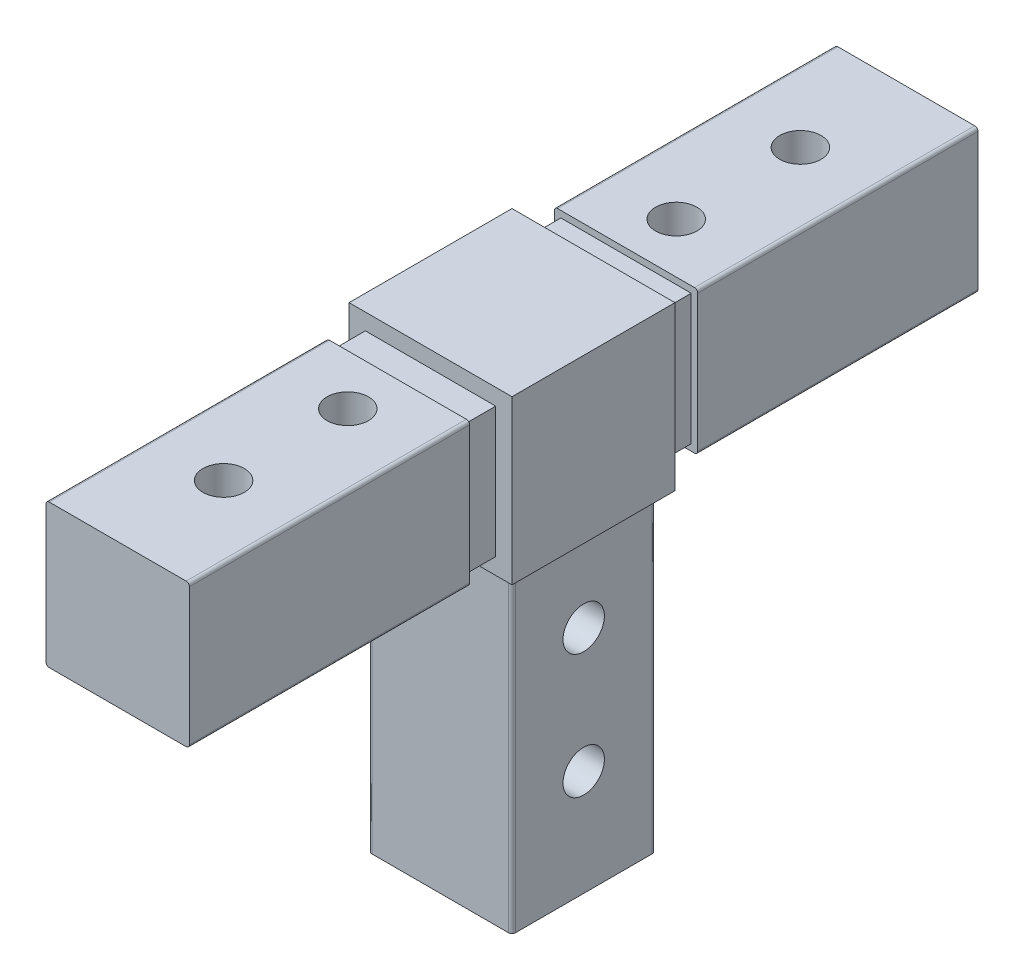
ISO-10303-21;
HEADER;
FILE_DESCRIPTION(('STEP AP214'),'2;1');
FILE_NAME('part.step','',(''),(''),'','','');
FILE_SCHEMA(('AUTOMOTIVE_DESIGN { 1 0 10303 214 1 1 1 1 }'));
ENDSEC;
DATA;
#1=APPLICATION_CONTEXT('core data for automotive mechanical design processes');
#2=APPLICATION_PROTOCOL_DEFINITION('international standard','automotive_design',2000,#1);
#3=PRODUCT_CONTEXT('',#1,'mechanical');
#4=PRODUCT('Part','Part','',(#3));
#5=PRODUCT_RELATED_PRODUCT_CATEGORY('part','',(#4));
#6=PRODUCT_DEFINITION_FORMATION('','',#4);
#7=PRODUCT_DEFINITION_CONTEXT('part definition',#1,'design');
#8=PRODUCT_DEFINITION('design','',#6,#7);
#9=PRODUCT_DEFINITION_SHAPE('','',#8);
#10=(LENGTH_UNIT() NAMED_UNIT(*) SI_UNIT(.MILLI.,.METRE.));
#11=(NAMED_UNIT(*) PLANE_ANGLE_UNIT() SI_UNIT($,.RADIAN.));
#12=(NAMED_UNIT(*) SI_UNIT($,.STERADIAN.) SOLID_ANGLE_UNIT());
#13=UNCERTAINTY_MEASURE_WITH_UNIT(LENGTH_MEASURE(1.E-05),#10,'distance_accuracy_value','');
#14=(GEOMETRIC_REPRESENTATION_CONTEXT(3) GLOBAL_UNCERTAINTY_ASSIGNED_CONTEXT((#13)) GLOBAL_UNIT_ASSIGNED_CONTEXT((#10,
#11,#12)) REPRESENTATION_CONTEXT('',''));
#15=CARTESIAN_POINT('',(0.,0.,0.));
#16=DIRECTION('',(0.,0.,1.));
#17=DIRECTION('',(1.,0.,0.));
#18=AXIS2_PLACEMENT_3D('',#15,#16,#17);
#19=CARTESIAN_POINT('',(0.,-12.5,0.));
#20=DIRECTION('',(0.,1.,0.));
#21=DIRECTION('',(0.,0.,1.));
#22=AXIS2_PLACEMENT_3D('',#19,#20,#21);
#23=PLANE('',#22);
#24=DIRECTION('',(0.,0.,1.));
#25=VECTOR('',#24,1.);
#26=CARTESIAN_POINT('',(12.5,-12.5,12.5));
#27=LINE('',#26,#25);
#28=CARTESIAN_POINT('',(12.5,-12.5,-12.5));
#29=VERTEX_POINT('',#28);
#30=CARTESIAN_POINT('',(12.5,-12.5,12.5));
#31=VERTEX_POINT('',#30);
#32=EDGE_CURVE('E347',#29,#31,#27,.T.);
#33=ORIENTED_EDGE('',*,*,#32,.T.);
#34=DIRECTION('',(-1.,0.,0.));
#35=VECTOR('',#34,1.);
#36=CARTESIAN_POINT('',(-12.5,-12.5,12.5));
#37=LINE('',#36,#35);
#38=CARTESIAN_POINT('',(-12.5,-12.5,12.5));
#39=VERTEX_POINT('',#38);
#40=EDGE_CURVE('E350',#31,#39,#37,.T.);
#41=ORIENTED_EDGE('',*,*,#40,.T.);
#42=DIRECTION('',(0.,0.,-1.));
#43=VECTOR('',#42,1.);
#44=CARTESIAN_POINT('',(-12.5,-12.5,-12.5));
#45=LINE('',#44,#43);
#46=CARTESIAN_POINT('',(-12.5,-12.5,-12.5));
#47=VERTEX_POINT('',#46);
#48=EDGE_CURVE('E353',#39,#47,#45,.T.);
#49=ORIENTED_EDGE('',*,*,#48,.T.);
#50=DIRECTION('',(1.,0.,0.));
#51=VECTOR('',#50,1.);
#52=CARTESIAN_POINT('',(12.5,-12.5,-12.5));
#53=LINE('',#52,#51);
#54=EDGE_CURVE('E356',#47,#29,#53,.T.);
#55=ORIENTED_EDGE('',*,*,#54,.T.);
#56=EDGE_LOOP('',(#33,#41,#49,#55));
#57=FACE_BOUND('',#56,.T.);
#58=DIRECTION('',(0.,0.,-1.));
#59=VECTOR('',#58,1.);
#60=CARTESIAN_POINT('',(-11.,-12.5,-11.));
#61=LINE('',#60,#59);
#62=CARTESIAN_POINT('',(-11.,-12.5,10.4999999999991));
#63=VERTEX_POINT('',#62);
#64=CARTESIAN_POINT('',(-11.,-12.5,-10.4999999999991));
#65=VERTEX_POINT('',#64);
#66=EDGE_CURVE('E927',#63,#65,#61,.T.);
#67=ORIENTED_EDGE('',*,*,#66,.F.);
#68=CARTESIAN_POINT('',(-10.4999999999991,-12.5,10.4999999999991));
#69=DIRECTION('',(0.,1.,0.));
#70=DIRECTION('',(0.,0.,1.));
#71=AXIS2_PLACEMENT_3D('',#68,#69,#70);
#72=CIRCLE('',#71,0.500000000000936);
#73=CARTESIAN_POINT('',(-10.4999999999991,-12.5,11.));
#74=VERTEX_POINT('',#73);
#75=EDGE_CURVE('E56',#63,#74,#72,.T.);
#76=ORIENTED_EDGE('',*,*,#75,.T.);
#77=DIRECTION('',(-1.,0.,0.));
#78=VECTOR('',#77,1.);
#79=CARTESIAN_POINT('',(-11.,-12.5,11.));
#80=LINE('',#79,#78);
#81=CARTESIAN_POINT('',(10.4999999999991,-12.5,11.));
#82=VERTEX_POINT('',#81);
#83=EDGE_CURVE('E925',#82,#74,#80,.T.);
#84=ORIENTED_EDGE('',*,*,#83,.F.);
#85=CARTESIAN_POINT('',(10.4999999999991,-12.5,10.4999999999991));
#86=DIRECTION('',(0.,1.,0.));
#87=DIRECTION('',(0.,0.,1.));
#88=AXIS2_PLACEMENT_3D('',#85,#86,#87);
#89=CIRCLE('',#88,0.500000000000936);
#90=CARTESIAN_POINT('',(11.,-12.5,10.4999999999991));
#91=VERTEX_POINT('',#90);
#92=EDGE_CURVE('E920',#82,#91,#89,.T.);
#93=ORIENTED_EDGE('',*,*,#92,.T.);
#94=DIRECTION('',(0.,0.,1.));
#95=VECTOR('',#94,1.);
#96=CARTESIAN_POINT('',(11.,-12.5,11.));
#97=LINE('',#96,#95);
#98=CARTESIAN_POINT('',(11.,-12.5,-10.4999999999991));
#99=VERTEX_POINT('',#98);
#100=EDGE_CURVE('E937',#99,#91,#97,.T.);
#101=ORIENTED_EDGE('',*,*,#100,.F.);
#102=CARTESIAN_POINT('',(10.4999999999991,-12.5,-10.4999999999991));
#103=DIRECTION('',(0.,1.,0.));
#104=DIRECTION('',(0.,0.,1.));
#105=AXIS2_PLACEMENT_3D('',#102,#103,#104);
#106=CIRCLE('',#105,0.500000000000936);
#107=CARTESIAN_POINT('',(10.4999999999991,-12.5,-11.));
#108=VERTEX_POINT('',#107);
#109=EDGE_CURVE('E12',#99,#108,#106,.T.);
#110=ORIENTED_EDGE('',*,*,#109,.T.);
#111=DIRECTION('',(1.,0.,0.));
#112=VECTOR('',#111,1.);
#113=CARTESIAN_POINT('',(11.,-12.5,-11.));
#114=LINE('',#113,#112);
#115=CARTESIAN_POINT('',(-10.4999999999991,-12.5,-11.));
#116=VERTEX_POINT('',#115);
#117=EDGE_CURVE('E962',#116,#108,#114,.T.);
#118=ORIENTED_EDGE('',*,*,#117,.F.);
#119=CARTESIAN_POINT('',(-10.4999999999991,-12.5,-10.4999999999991));
#120=DIRECTION('',(0.,1.,0.));
#121=DIRECTION('',(0.,0.,1.));
#122=AXIS2_PLACEMENT_3D('',#119,#120,#121);
#123=CIRCLE('',#122,0.500000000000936);
#124=EDGE_CURVE('E918',#116,#65,#123,.T.);
#125=ORIENTED_EDGE('',*,*,#124,.T.);
#126=EDGE_LOOP('',(#67,#76,#84,#93,#101,#110,#118,#125));
#127=FACE_BOUND('',#126,.T.);
#128=ADVANCED_FACE('F48',(#57,#127),#23,.F.);
#129=CARTESIAN_POINT('',(-10.,11.,-60.5));
#130=DIRECTION('',(1.,0.,0.));
#131=DIRECTION('',(0.,0.,-1.));
#132=AXIS2_PLACEMENT_3D('',#129,#130,#131);
#133=PLANE('',#132);
#134=DIRECTION('',(0.,1.,0.));
#135=VECTOR('',#134,1.);
#136=CARTESIAN_POINT('',(-10.,11.,-17.5));
#137=LINE('',#136,#135);
#138=CARTESIAN_POINT('',(-10.,-10.,-17.5));
#139=VERTEX_POINT('',#138);
#140=CARTESIAN_POINT('',(-10.,10.,-17.5));
#141=VERTEX_POINT('',#140);
#142=EDGE_CURVE('E282',#139,#141,#137,.T.);
#143=ORIENTED_EDGE('',*,*,#142,.F.);
#144=DIRECTION('',(0.,0.,1.));
#145=VECTOR('',#144,1.);
#146=CARTESIAN_POINT('',(-10.,-10.,-17.5));
#147=LINE('',#146,#145);
#148=CARTESIAN_POINT('',(-10.,-10.,-12.5));
#149=VERTEX_POINT('',#148);
#150=EDGE_CURVE('E286',#139,#149,#147,.T.);
#151=ORIENTED_EDGE('',*,*,#150,.T.);
#152=DIRECTION('',(0.,1.,0.));
#153=VECTOR('',#152,1.);
#154=CARTESIAN_POINT('',(-10.,11.,-12.5));
#155=LINE('',#154,#153);
#156=CARTESIAN_POINT('',(-10.,10.,-12.5));
#157=VERTEX_POINT('',#156);
#158=EDGE_CURVE('E332',#149,#157,#155,.T.);
#159=ORIENTED_EDGE('',*,*,#158,.T.);
#160=DIRECTION('',(0.,0.,1.));
#161=VECTOR('',#160,1.);
#162=CARTESIAN_POINT('',(-10.,10.,-17.5));
#163=LINE('',#162,#161);
#164=EDGE_CURVE('E288',#141,#157,#163,.T.);
#165=ORIENTED_EDGE('',*,*,#164,.F.);
#166=EDGE_LOOP('',(#143,#151,#159,#165));
#167=FACE_BOUND('',#166,.T.);
#168=ADVANCED_FACE('F284',(#167),#133,.F.);
#169=CARTESIAN_POINT('',(11.,11.,-60.5));
#170=DIRECTION('',(0.,-1.,0.));
#171=DIRECTION('',(0.,0.,-1.));
#172=AXIS2_PLACEMENT_3D('',#169,#170,#171);
#173=PLANE('',#172);
#174=CARTESIAN_POINT('',(0.,11.,-44.25));
#175=DIRECTION('',(0.,1.,0.));
#176=DIRECTION('',(-1.,0.,0.));
#177=AXIS2_PLACEMENT_3D('',#174,#175,#176);
#178=CIRCLE('',#177,3.175);
#179=CARTESIAN_POINT('',(-3.175,11.,-44.25));
#180=VERTEX_POINT('',#179);
#181=EDGE_CURVE('E1197',#180,#180,#178,.T.);
#182=ORIENTED_EDGE('',*,*,#181,.F.);
#183=EDGE_LOOP('',(#182));
#184=FACE_BOUND('',#183,.T.);
#185=CARTESIAN_POINT('',(0.,11.,-25.2));
#186=DIRECTION('',(0.,1.,0.));
#187=DIRECTION('',(-1.,0.,0.));
#188=AXIS2_PLACEMENT_3D('',#185,#186,#187);
#189=CIRCLE('',#188,3.175);
#190=CARTESIAN_POINT('',(-3.175,11.,-25.2));
#191=VERTEX_POINT('',#190);
#192=EDGE_CURVE('E1190',#191,#191,#189,.T.);
#193=ORIENTED_EDGE('',*,*,#192,.F.);
#194=EDGE_LOOP('',(#193));
#195=FACE_BOUND('',#194,.T.);
#196=DIRECTION('',(1.,0.,0.));
#197=VECTOR('',#196,1.);
#198=CARTESIAN_POINT('',(11.,11.,-60.5));
#199=LINE('',#198,#197);
#200=CARTESIAN_POINT('',(-10.4999999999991,11.,-60.5));
#201=VERTEX_POINT('',#200);
#202=CARTESIAN_POINT('',(10.4999999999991,11.,-60.5));
#203=VERTEX_POINT('',#202);
#204=EDGE_CURVE('E336',#201,#203,#199,.T.);
#205=ORIENTED_EDGE('',*,*,#204,.F.);
#206=DIRECTION('',(0.,0.,-1.));
#207=VECTOR('',#206,1.);
#208=CARTESIAN_POINT('',(-10.4999999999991,11.,-60.5));
#209=LINE('',#208,#207);
#210=CARTESIAN_POINT('',(-10.4999999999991,11.,-17.5));
#211=VERTEX_POINT('',#210);
#212=EDGE_CURVE('E916',#201,#211,#209,.F.);
#213=ORIENTED_EDGE('',*,*,#212,.T.);
#214=DIRECTION('',(-1.,0.,0.));
#215=VECTOR('',#214,1.);
#216=CARTESIAN_POINT('',(11.,11.,-17.5));
#217=LINE('',#216,#215);
#218=CARTESIAN_POINT('',(10.4999999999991,11.,-17.5));
#219=VERTEX_POINT('',#218);
#220=EDGE_CURVE('E320',#219,#211,#217,.T.);
#221=ORIENTED_EDGE('',*,*,#220,.F.);
#222=DIRECTION('',(0.,0.,1.));
#223=VECTOR('',#222,1.);
#224=CARTESIAN_POINT('',(10.4999999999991,11.,-60.5));
#225=LINE('',#224,#223);
#226=EDGE_CURVE('E914',#219,#203,#225,.F.);
#227=ORIENTED_EDGE('',*,*,#226,.T.);
#228=EDGE_LOOP('',(#205,#213,#221,#227));
#229=FACE_BOUND('',#228,.T.);
#230=ADVANCED_FACE('F980',(#184,#195,#229),#173,.F.);
#231=CARTESIAN_POINT('',(11.,-11.,-60.5));
#232=DIRECTION('',(-1.,0.,0.));
#233=DIRECTION('',(0.,-1.,0.));
#234=AXIS2_PLACEMENT_3D('',#231,#232,#233);
#235=PLANE('',#234);
#236=DIRECTION('',(0.,1.,0.));
#237=VECTOR('',#236,1.);
#238=CARTESIAN_POINT('',(11.,-11.,-17.5));
#239=LINE('',#238,#237);
#240=CARTESIAN_POINT('',(11.,-10.4999999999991,-17.5));
#241=VERTEX_POINT('',#240);
#242=CARTESIAN_POINT('',(11.,10.4999999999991,-17.5));
#243=VERTEX_POINT('',#242);
#244=EDGE_CURVE('E311',#241,#243,#239,.T.);
#245=ORIENTED_EDGE('',*,*,#244,.F.);
#246=DIRECTION('',(0.,0.,1.));
#247=VECTOR('',#246,1.);
#248=CARTESIAN_POINT('',(11.,-10.4999999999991,-60.5));
#249=LINE('',#248,#247);
#250=CARTESIAN_POINT('',(11.,-10.4999999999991,-60.5));
#251=VERTEX_POINT('',#250);
#252=EDGE_CURVE('E903',#241,#251,#249,.F.);
#253=ORIENTED_EDGE('',*,*,#252,.T.);
#254=DIRECTION('',(0.,-1.,0.));
#255=VECTOR('',#254,1.);
#256=CARTESIAN_POINT('',(11.,-11.,-60.5));
#257=LINE('',#256,#255);
#258=CARTESIAN_POINT('',(11.,10.4999999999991,-60.5));
#259=VERTEX_POINT('',#258);
#260=EDGE_CURVE('E339',#259,#251,#257,.T.);
#261=ORIENTED_EDGE('',*,*,#260,.F.);
#262=DIRECTION('',(0.,0.,1.));
#263=VECTOR('',#262,1.);
#264=CARTESIAN_POINT('',(11.,10.4999999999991,-60.5));
#265=LINE('',#264,#263);
#266=EDGE_CURVE('E900',#259,#243,#265,.T.);
#267=ORIENTED_EDGE('',*,*,#266,.T.);
#268=EDGE_LOOP('',(#245,#253,#261,#267));
#269=FACE_BOUND('',#268,.T.);
#270=ADVANCED_FACE('F989',(#269),#235,.F.);
#271=CARTESIAN_POINT('',(-10.,-11.,-60.5));
#272=DIRECTION('',(0.,1.,0.));
#273=DIRECTION('',(0.,0.,1.));
#274=AXIS2_PLACEMENT_3D('',#271,#272,#273);
#275=PLANE('',#274);
#276=CARTESIAN_POINT('',(0.,-11.,-44.25));
#277=DIRECTION('',(0.,-1.,0.));
#278=DIRECTION('',(0.,0.,-1.));
#279=AXIS2_PLACEMENT_3D('',#276,#277,#278);
#280=CIRCLE('',#279,3.175);
#281=CARTESIAN_POINT('',(0.,-11.,-47.425));
#282=VERTEX_POINT('',#281);
#283=EDGE_CURVE('E1200',#282,#282,#280,.F.);
#284=ORIENTED_EDGE('',*,*,#283,.T.);
#285=EDGE_LOOP('',(#284));
#286=FACE_BOUND('',#285,.T.);
#287=CARTESIAN_POINT('',(0.,-11.,-25.2));
#288=DIRECTION('',(0.,-1.,0.));
#289=DIRECTION('',(0.,0.,-1.));
#290=AXIS2_PLACEMENT_3D('',#287,#288,#289);
#291=CIRCLE('',#290,3.175);
#292=CARTESIAN_POINT('',(0.,-11.,-28.375));
#293=VERTEX_POINT('',#292);
#294=EDGE_CURVE('E1194',#293,#293,#291,.F.);
#295=ORIENTED_EDGE('',*,*,#294,.T.);
#296=EDGE_LOOP('',(#295));
#297=FACE_BOUND('',#296,.T.);
#298=DIRECTION('',(1.,0.,0.));
#299=VECTOR('',#298,1.);
#300=CARTESIAN_POINT('',(-10.,-11.,-17.5));
#301=LINE('',#300,#299);
#302=CARTESIAN_POINT('',(-10.4999999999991,-11.,-17.5));
#303=VERTEX_POINT('',#302);
#304=CARTESIAN_POINT('',(10.4999999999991,-11.,-17.5));
#305=VERTEX_POINT('',#304);
#306=EDGE_CURVE('E307',#303,#305,#301,.T.);
#307=ORIENTED_EDGE('',*,*,#306,.F.);
#308=DIRECTION('',(0.,0.,1.));
#309=VECTOR('',#308,1.);
#310=CARTESIAN_POINT('',(-10.4999999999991,-11.,-60.5));
#311=LINE('',#310,#309);
#312=CARTESIAN_POINT('',(-10.4999999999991,-11.,-60.5));
#313=VERTEX_POINT('',#312);
#314=EDGE_CURVE('E837',#303,#313,#311,.F.);
#315=ORIENTED_EDGE('',*,*,#314,.T.);
#316=DIRECTION('',(-1.,0.,0.));
#317=VECTOR('',#316,1.);
#318=CARTESIAN_POINT('',(-10.,-11.,-60.5));
#319=LINE('',#318,#317);
#320=CARTESIAN_POINT('',(10.4999999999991,-11.,-60.5));
#321=VERTEX_POINT('',#320);
#322=EDGE_CURVE('E342',#321,#313,#319,.T.);
#323=ORIENTED_EDGE('',*,*,#322,.F.);
#324=DIRECTION('',(0.,0.,1.));
#325=VECTOR('',#324,1.);
#326=CARTESIAN_POINT('',(10.4999999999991,-11.,-60.5));
#327=LINE('',#326,#325);
#328=EDGE_CURVE('E834',#321,#305,#327,.T.);
#329=ORIENTED_EDGE('',*,*,#328,.T.);
#330=EDGE_LOOP('',(#307,#315,#323,#329));
#331=FACE_BOUND('',#330,.T.);
#332=ADVANCED_FACE('F998',(#286,#297,#331),#275,.F.);
#333=CARTESIAN_POINT('',(0.,0.,-12.5));
#334=DIRECTION('',(0.,0.,1.));
#335=DIRECTION('',(1.,0.,0.));
#336=AXIS2_PLACEMENT_3D('',#333,#334,#335);
#337=PLANE('',#336);
#338=DIRECTION('',(1.,0.,0.));
#339=VECTOR('',#338,1.);
#340=CARTESIAN_POINT('',(-10.,10.,-12.5));
#341=LINE('',#340,#339);
#342=CARTESIAN_POINT('',(10.,10.,-12.5));
#343=VERTEX_POINT('',#342);
#344=EDGE_CURVE('E314',#157,#343,#341,.T.);
#345=ORIENTED_EDGE('',*,*,#344,.F.);
#346=ORIENTED_EDGE('',*,*,#158,.F.);
#347=DIRECTION('',(-1.,0.,0.));
#348=VECTOR('',#347,1.);
#349=CARTESIAN_POINT('',(10.,-10.,-12.5));
#350=LINE('',#349,#348);
#351=CARTESIAN_POINT('',(10.,-10.,-12.5));
#352=VERTEX_POINT('',#351);
#353=EDGE_CURVE('E302',#352,#149,#350,.T.);
#354=ORIENTED_EDGE('',*,*,#353,.F.);
#355=DIRECTION('',(0.,-1.,0.));
#356=VECTOR('',#355,1.);
#357=CARTESIAN_POINT('',(10.,10.,-12.5));
#358=LINE('',#357,#356);
#359=EDGE_CURVE('E308',#343,#352,#358,.T.);
#360=ORIENTED_EDGE('',*,*,#359,.F.);
#361=EDGE_LOOP('',(#345,#346,#354,#360));
#362=FACE_BOUND('',#361,.T.);
#363=DIRECTION('',(0.,-1.,0.));
#364=VECTOR('',#363,1.);
#365=CARTESIAN_POINT('',(-12.5,12.5,-12.5));
#366=LINE('',#365,#364);
#367=CARTESIAN_POINT('',(-12.5,12.5,-12.5));
#368=VERTEX_POINT('',#367);
#369=EDGE_CURVE('E805',#368,#47,#366,.T.);
#370=ORIENTED_EDGE('',*,*,#369,.F.);
#371=DIRECTION('',(-1.,0.,0.));
#372=VECTOR('',#371,1.);
#373=CARTESIAN_POINT('',(-12.5,12.5,-12.5));
#374=LINE('',#373,#372);
#375=CARTESIAN_POINT('',(12.5,12.5,-12.5));
#376=VERTEX_POINT('',#375);
#377=EDGE_CURVE('E370',#376,#368,#374,.T.);
#378=ORIENTED_EDGE('',*,*,#377,.F.);
#379=DIRECTION('',(0.,1.,0.));
#380=VECTOR('',#379,1.);
#381=CARTESIAN_POINT('',(12.5,-12.5,-12.5));
#382=LINE('',#381,#380);
#383=EDGE_CURVE('E548',#29,#376,#382,.T.);
#384=ORIENTED_EDGE('',*,*,#383,.F.);
#385=ORIENTED_EDGE('',*,*,#54,.F.);
#386=EDGE_LOOP('',(#370,#378,#384,#385));
#387=FACE_BOUND('',#386,.T.);
#388=ADVANCED_FACE('F1066',(#362,#387),#337,.F.);
#389=CARTESIAN_POINT('',(-10.,-10.,17.5));
#390=DIRECTION('',(0.,1.,0.));
#391=DIRECTION('',(0.,0.,1.));
#392=AXIS2_PLACEMENT_3D('',#389,#390,#391);
#393=PLANE('',#392);
#394=DIRECTION('',(-1.,0.,0.));
#395=VECTOR('',#394,1.);
#396=CARTESIAN_POINT('',(-12.5,-10.,12.5));
#397=LINE('',#396,#395);
#398=CARTESIAN_POINT('',(10.,-10.,12.5));
#399=VERTEX_POINT('',#398);
#400=CARTESIAN_POINT('',(-10.,-10.,12.5));
#401=VERTEX_POINT('',#400);
#402=EDGE_CURVE('E345',#399,#401,#397,.T.);
#403=ORIENTED_EDGE('',*,*,#402,.F.);
#404=DIRECTION('',(0.,0.,-1.));
#405=VECTOR('',#404,1.);
#406=CARTESIAN_POINT('',(10.,-10.,17.5));
#407=LINE('',#406,#405);
#408=CARTESIAN_POINT('',(10.,-10.,17.5));
#409=VERTEX_POINT('',#408);
#410=EDGE_CURVE('E421',#409,#399,#407,.T.);
#411=ORIENTED_EDGE('',*,*,#410,.F.);
#412=DIRECTION('',(1.,0.,0.));
#413=VECTOR('',#412,1.);
#414=CARTESIAN_POINT('',(10.,-10.,17.5));
#415=LINE('',#414,#413);
#416=CARTESIAN_POINT('',(-10.,-10.,17.5));
#417=VERTEX_POINT('',#416);
#418=EDGE_CURVE('E402',#417,#409,#415,.T.);
#419=ORIENTED_EDGE('',*,*,#418,.F.);
#420=DIRECTION('',(0.,0.,-1.));
#421=VECTOR('',#420,1.);
#422=CARTESIAN_POINT('',(-10.,-10.,17.5));
#423=LINE('',#422,#421);
#424=EDGE_CURVE('E424',#417,#401,#423,.T.);
#425=ORIENTED_EDGE('',*,*,#424,.T.);
#426=EDGE_LOOP('',(#403,#411,#419,#425));
#427=FACE_BOUND('',#426,.T.);
#428=ADVANCED_FACE('F1062',(#427),#393,.F.);
#429=CARTESIAN_POINT('',(10.,10.,17.5));
#430=DIRECTION('',(0.,-1.,0.));
#431=DIRECTION('',(0.,0.,-1.));
#432=AXIS2_PLACEMENT_3D('',#429,#430,#431);
#433=PLANE('',#432);
#434=DIRECTION('',(1.,0.,0.));
#435=VECTOR('',#434,1.);
#436=CARTESIAN_POINT('',(12.5,10.,12.5));
#437=LINE('',#436,#435);
#438=CARTESIAN_POINT('',(-10.,10.,12.5));
#439=VERTEX_POINT('',#438);
#440=CARTESIAN_POINT('',(10.,10.,12.5));
#441=VERTEX_POINT('',#440);
#442=EDGE_CURVE('E359',#439,#441,#437,.T.);
#443=ORIENTED_EDGE('',*,*,#442,.F.);
#444=DIRECTION('',(0.,0.,-1.));
#445=VECTOR('',#444,1.);
#446=CARTESIAN_POINT('',(-10.,10.,17.5));
#447=LINE('',#446,#445);
#448=CARTESIAN_POINT('',(-10.,10.,17.5));
#449=VERTEX_POINT('',#448);
#450=EDGE_CURVE('E412',#449,#439,#447,.T.);
#451=ORIENTED_EDGE('',*,*,#450,.F.);
#452=DIRECTION('',(-1.,0.,0.));
#453=VECTOR('',#452,1.);
#454=CARTESIAN_POINT('',(-10.,10.,17.5));
#455=LINE('',#454,#453);
#456=CARTESIAN_POINT('',(10.,10.,17.5));
#457=VERTEX_POINT('',#456);
#458=EDGE_CURVE('E409',#457,#449,#455,.T.);
#459=ORIENTED_EDGE('',*,*,#458,.F.);
#460=DIRECTION('',(0.,0.,-1.));
#461=VECTOR('',#460,1.);
#462=CARTESIAN_POINT('',(10.,10.,17.5));
#463=LINE('',#462,#461);
#464=EDGE_CURVE('E418',#457,#441,#463,.T.);
#465=ORIENTED_EDGE('',*,*,#464,.T.);
#466=EDGE_LOOP('',(#443,#451,#459,#465));
#467=FACE_BOUND('',#466,.T.);
#468=ADVANCED_FACE('F1058',(#467),#433,.F.);
#469=CARTESIAN_POINT('',(0.,0.,12.5));
#470=DIRECTION('',(0.,0.,1.));
#471=DIRECTION('',(1.,0.,0.));
#472=AXIS2_PLACEMENT_3D('',#469,#470,#471);
#473=PLANE('',#472);
#474=ORIENTED_EDGE('',*,*,#40,.F.);
#475=DIRECTION('',(0.,1.,0.));
#476=VECTOR('',#475,1.);
#477=CARTESIAN_POINT('',(12.5,-12.5,12.5));
#478=LINE('',#477,#476);
#479=CARTESIAN_POINT('',(12.5,12.5,12.5));
#480=VERTEX_POINT('',#479);
#481=EDGE_CURVE('E806',#31,#480,#478,.T.);
#482=ORIENTED_EDGE('',*,*,#481,.T.);
#483=DIRECTION('',(1.,0.,0.));
#484=VECTOR('',#483,1.);
#485=CARTESIAN_POINT('',(12.5,12.5,12.5));
#486=LINE('',#485,#484);
#487=CARTESIAN_POINT('',(-12.5,12.5,12.5));
#488=VERTEX_POINT('',#487);
#489=EDGE_CURVE('E364',#488,#480,#486,.T.);
#490=ORIENTED_EDGE('',*,*,#489,.F.);
#491=DIRECTION('',(0.,-1.,0.));
#492=VECTOR('',#491,1.);
#493=CARTESIAN_POINT('',(-12.5,12.5,12.5));
#494=LINE('',#493,#492);
#495=EDGE_CURVE('E427',#488,#39,#494,.T.);
#496=ORIENTED_EDGE('',*,*,#495,.T.);
#497=EDGE_LOOP('',(#474,#482,#490,#496));
#498=FACE_BOUND('',#497,.T.);
#499=DIRECTION('',(0.,1.,0.));
#500=VECTOR('',#499,1.);
#501=CARTESIAN_POINT('',(10.,10.,12.5));
#502=LINE('',#501,#500);
#503=EDGE_CURVE('E403',#399,#441,#502,.T.);
#504=ORIENTED_EDGE('',*,*,#503,.F.);
#505=ORIENTED_EDGE('',*,*,#402,.T.);
#506=DIRECTION('',(0.,-1.,0.));
#507=VECTOR('',#506,1.);
#508=CARTESIAN_POINT('',(-10.,-10.,12.5));
#509=LINE('',#508,#507);
#510=EDGE_CURVE('E388',#439,#401,#509,.T.);
#511=ORIENTED_EDGE('',*,*,#510,.F.);
#512=ORIENTED_EDGE('',*,*,#442,.T.);
#513=EDGE_LOOP('',(#504,#505,#511,#512));
#514=FACE_BOUND('',#513,.T.);
#515=ADVANCED_FACE('F1061',(#498,#514),#473,.T.);
#516=CARTESIAN_POINT('',(-12.5,12.5,12.5));
#517=DIRECTION('',(1.,0.,0.));
#518=DIRECTION('',(0.,0.,-1.));
#519=AXIS2_PLACEMENT_3D('',#516,#517,#518);
#520=PLANE('',#519);
#521=ORIENTED_EDGE('',*,*,#495,.F.);
#522=DIRECTION('',(0.,0.,1.));
#523=VECTOR('',#522,1.);
#524=CARTESIAN_POINT('',(-12.5,12.5,12.5));
#525=LINE('',#524,#523);
#526=EDGE_CURVE('E361',#368,#488,#525,.T.);
#527=ORIENTED_EDGE('',*,*,#526,.F.);
#528=ORIENTED_EDGE('',*,*,#369,.T.);
#529=ORIENTED_EDGE('',*,*,#48,.F.);
#530=EDGE_LOOP('',(#521,#527,#528,#529));
#531=FACE_BOUND('',#530,.T.);
#532=ADVANCED_FACE('F1070',(#531),#520,.F.);
#533=CARTESIAN_POINT('',(12.5,-12.5,12.5));
#534=DIRECTION('',(-1.,0.,0.));
#535=DIRECTION('',(0.,0.,1.));
#536=AXIS2_PLACEMENT_3D('',#533,#534,#535);
#537=PLANE('',#536);
#538=ORIENTED_EDGE('',*,*,#383,.T.);
#539=DIRECTION('',(0.,0.,-1.));
#540=VECTOR('',#539,1.);
#541=CARTESIAN_POINT('',(12.5,12.5,-12.5));
#542=LINE('',#541,#540);
#543=EDGE_CURVE('E367',#480,#376,#542,.T.);
#544=ORIENTED_EDGE('',*,*,#543,.F.);
#545=ORIENTED_EDGE('',*,*,#481,.F.);
#546=ORIENTED_EDGE('',*,*,#32,.F.);
#547=EDGE_LOOP('',(#538,#544,#545,#546));
#548=FACE_BOUND('',#547,.T.);
#549=ADVANCED_FACE('F1056',(#548),#537,.F.);
#550=CARTESIAN_POINT('',(-10.,-10.,17.5));
#551=DIRECTION('',(1.,0.,0.));
#552=DIRECTION('',(0.,0.,-1.));
#553=AXIS2_PLACEMENT_3D('',#550,#551,#552);
#554=PLANE('',#553);
#555=ORIENTED_EDGE('',*,*,#510,.T.);
#556=ORIENTED_EDGE('',*,*,#424,.F.);
#557=DIRECTION('',(0.,-1.,0.));
#558=VECTOR('',#557,1.);
#559=CARTESIAN_POINT('',(-10.,-10.,17.5));
#560=LINE('',#559,#558);
#561=EDGE_CURVE('E399',#449,#417,#560,.T.);
#562=ORIENTED_EDGE('',*,*,#561,.F.);
#563=ORIENTED_EDGE('',*,*,#450,.T.);
#564=EDGE_LOOP('',(#555,#556,#562,#563));
#565=FACE_BOUND('',#564,.T.);
#566=ADVANCED_FACE('F1052',(#565),#554,.F.);
#567=CARTESIAN_POINT('',(10.,10.,17.5));
#568=DIRECTION('',(-1.,0.,0.));
#569=DIRECTION('',(0.,0.,1.));
#570=AXIS2_PLACEMENT_3D('',#567,#568,#569);
#571=PLANE('',#570);
#572=ORIENTED_EDGE('',*,*,#503,.T.);
#573=ORIENTED_EDGE('',*,*,#464,.F.);
#574=DIRECTION('',(0.,1.,0.));
#575=VECTOR('',#574,1.);
#576=CARTESIAN_POINT('',(10.,10.,17.5));
#577=LINE('',#576,#575);
#578=EDGE_CURVE('E406',#409,#457,#577,.T.);
#579=ORIENTED_EDGE('',*,*,#578,.F.);
#580=ORIENTED_EDGE('',*,*,#410,.T.);
#581=EDGE_LOOP('',(#572,#573,#579,#580));
#582=FACE_BOUND('',#581,.T.);
#583=ADVANCED_FACE('F1048',(#582),#571,.F.);
#584=CARTESIAN_POINT('',(11.,-11.,60.5));
#585=DIRECTION('',(0.,-1.,0.));
#586=DIRECTION('',(0.,0.,-1.));
#587=AXIS2_PLACEMENT_3D('',#584,#585,#586);
#588=PLANE('',#587);
#589=CARTESIAN_POINT('',(0.,-11.,44.25));
#590=DIRECTION('',(0.,-1.,0.));
#591=DIRECTION('',(0.,0.,-1.));
#592=AXIS2_PLACEMENT_3D('',#589,#590,#591);
#593=CIRCLE('',#592,3.175);
#594=CARTESIAN_POINT('',(0.,-11.,41.075));
#595=VERTEX_POINT('',#594);
#596=EDGE_CURVE('E1186',#595,#595,#593,.F.);
#597=ORIENTED_EDGE('',*,*,#596,.T.);
#598=EDGE_LOOP('',(#597));
#599=FACE_BOUND('',#598,.T.);
#600=CARTESIAN_POINT('',(0.,-11.,25.2));
#601=DIRECTION('',(0.,-1.,0.));
#602=DIRECTION('',(0.,0.,-1.));
#603=AXIS2_PLACEMENT_3D('',#600,#601,#602);
#604=CIRCLE('',#603,3.175);
#605=CARTESIAN_POINT('',(0.,-11.,22.025));
#606=VERTEX_POINT('',#605);
#607=EDGE_CURVE('E955',#606,#606,#604,.F.);
#608=ORIENTED_EDGE('',*,*,#607,.T.);
#609=EDGE_LOOP('',(#608));
#610=FACE_BOUND('',#609,.T.);
#611=DIRECTION('',(-1.,0.,0.));
#612=VECTOR('',#611,1.);
#613=CARTESIAN_POINT('',(11.,-11.,17.5));
#614=LINE('',#613,#612);
#615=CARTESIAN_POINT('',(10.4999999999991,-11.,17.5));
#616=VERTEX_POINT('',#615);
#617=CARTESIAN_POINT('',(-10.4999999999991,-11.,17.5));
#618=VERTEX_POINT('',#617);
#619=EDGE_CURVE('E373',#616,#618,#614,.T.);
#620=ORIENTED_EDGE('',*,*,#619,.F.);
#621=DIRECTION('',(0.,0.,-1.));
#622=VECTOR('',#621,1.);
#623=CARTESIAN_POINT('',(10.4999999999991,-11.,60.5));
#624=LINE('',#623,#622);
#625=CARTESIAN_POINT('',(10.4999999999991,-11.,60.5));
#626=VERTEX_POINT('',#625);
#627=EDGE_CURVE('E891',#616,#626,#624,.F.);
#628=ORIENTED_EDGE('',*,*,#627,.T.);
#629=DIRECTION('',(-1.,0.,0.));
#630=VECTOR('',#629,1.);
#631=CARTESIAN_POINT('',(11.,-11.,60.5));
#632=LINE('',#631,#630);
#633=CARTESIAN_POINT('',(-10.4999999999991,-11.,60.5));
#634=VERTEX_POINT('',#633);
#635=EDGE_CURVE('E376',#626,#634,#632,.T.);
#636=ORIENTED_EDGE('',*,*,#635,.T.);
#637=DIRECTION('',(0.,0.,-1.));
#638=VECTOR('',#637,1.);
#639=CARTESIAN_POINT('',(-10.4999999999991,-11.,60.5));
#640=LINE('',#639,#638);
#641=EDGE_CURVE('E888',#634,#618,#640,.T.);
#642=ORIENTED_EDGE('',*,*,#641,.T.);
#643=EDGE_LOOP('',(#620,#628,#636,#642));
#644=FACE_BOUND('',#643,.T.);
#645=ADVANCED_FACE('F1039',(#599,#610,#644),#588,.T.);
#646=CARTESIAN_POINT('',(11.,11.,60.5));
#647=DIRECTION('',(1.,0.,0.));
#648=DIRECTION('',(0.,1.,0.));
#649=AXIS2_PLACEMENT_3D('',#646,#647,#648);
#650=PLANE('',#649);
#651=DIRECTION('',(0.,-1.,0.));
#652=VECTOR('',#651,1.);
#653=CARTESIAN_POINT('',(11.,11.,60.5));
#654=LINE('',#653,#652);
#655=CARTESIAN_POINT('',(11.,10.4999999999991,60.5));
#656=VERTEX_POINT('',#655);
#657=CARTESIAN_POINT('',(11.,-10.4999999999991,60.5));
#658=VERTEX_POINT('',#657);
#659=EDGE_CURVE('E385',#656,#658,#654,.T.);
#660=ORIENTED_EDGE('',*,*,#659,.T.);
#661=DIRECTION('',(0.,0.,-1.));
#662=VECTOR('',#661,1.);
#663=CARTESIAN_POINT('',(11.,-10.4999999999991,60.5));
#664=LINE('',#663,#662);
#665=CARTESIAN_POINT('',(11.,-10.4999999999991,17.5));
#666=VERTEX_POINT('',#665);
#667=EDGE_CURVE('E877',#658,#666,#664,.T.);
#668=ORIENTED_EDGE('',*,*,#667,.T.);
#669=DIRECTION('',(0.,-1.,0.));
#670=VECTOR('',#669,1.);
#671=CARTESIAN_POINT('',(11.,11.,17.5));
#672=LINE('',#671,#670);
#673=CARTESIAN_POINT('',(11.,10.4999999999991,17.5));
#674=VERTEX_POINT('',#673);
#675=EDGE_CURVE('E380',#674,#666,#672,.T.);
#676=ORIENTED_EDGE('',*,*,#675,.F.);
#677=DIRECTION('',(0.,0.,-1.));
#678=VECTOR('',#677,1.);
#679=CARTESIAN_POINT('',(11.,10.4999999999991,60.5));
#680=LINE('',#679,#678);
#681=EDGE_CURVE('E875',#674,#656,#680,.F.);
#682=ORIENTED_EDGE('',*,*,#681,.T.);
#683=EDGE_LOOP('',(#660,#668,#676,#682));
#684=FACE_BOUND('',#683,.T.);
#685=ADVANCED_FACE('F1035',(#684),#650,.T.);
#686=CARTESIAN_POINT('',(-11.,11.,60.5));
#687=DIRECTION('',(0.,1.,0.));
#688=DIRECTION('',(-1.,0.,0.));
#689=AXIS2_PLACEMENT_3D('',#686,#687,#688);
#690=PLANE('',#689);
#691=CARTESIAN_POINT('',(0.,11.,44.25));
#692=DIRECTION('',(0.,1.,0.));
#693=DIRECTION('',(-1.,0.,0.));
#694=AXIS2_PLACEMENT_3D('',#691,#692,#693);
#695=CIRCLE('',#694,3.175);
#696=CARTESIAN_POINT('',(-3.175,11.,44.25));
#697=VERTEX_POINT('',#696);
#698=EDGE_CURVE('E1189',#697,#697,#695,.T.);
#699=ORIENTED_EDGE('',*,*,#698,.F.);
#700=EDGE_LOOP('',(#699));
#701=FACE_BOUND('',#700,.T.);
#702=CARTESIAN_POINT('',(0.,11.,25.2));
#703=DIRECTION('',(0.,1.,0.));
#704=DIRECTION('',(-1.,0.,0.));
#705=AXIS2_PLACEMENT_3D('',#702,#703,#704);
#706=CIRCLE('',#705,3.175);
#707=CARTESIAN_POINT('',(-3.175,11.,25.2));
#708=VERTEX_POINT('',#707);
#709=EDGE_CURVE('E1193',#708,#708,#706,.T.);
#710=ORIENTED_EDGE('',*,*,#709,.F.);
#711=EDGE_LOOP('',(#710));
#712=FACE_BOUND('',#711,.T.);
#713=DIRECTION('',(1.,0.,0.));
#714=VECTOR('',#713,1.);
#715=CARTESIAN_POINT('',(-11.,11.,60.5));
#716=LINE('',#715,#714);
#717=CARTESIAN_POINT('',(-10.4999999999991,11.,60.5));
#718=VERTEX_POINT('',#717);
#719=CARTESIAN_POINT('',(10.4999999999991,11.,60.5));
#720=VERTEX_POINT('',#719);
#721=EDGE_CURVE('E382',#718,#720,#716,.T.);
#722=ORIENTED_EDGE('',*,*,#721,.T.);
#723=DIRECTION('',(0.,0.,-1.));
#724=VECTOR('',#723,1.);
#725=CARTESIAN_POINT('',(10.4999999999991,11.,60.5));
#726=LINE('',#725,#724);
#727=CARTESIAN_POINT('',(10.4999999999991,11.,17.5));
#728=VERTEX_POINT('',#727);
#729=EDGE_CURVE('E907',#720,#728,#726,.T.);
#730=ORIENTED_EDGE('',*,*,#729,.T.);
#731=DIRECTION('',(1.,0.,0.));
#732=VECTOR('',#731,1.);
#733=CARTESIAN_POINT('',(-11.,11.,17.5));
#734=LINE('',#733,#732);
#735=CARTESIAN_POINT('',(-10.4999999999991,11.,17.5));
#736=VERTEX_POINT('',#735);
#737=EDGE_CURVE('E394',#736,#728,#734,.T.);
#738=ORIENTED_EDGE('',*,*,#737,.F.);
#739=DIRECTION('',(0.,0.,-1.));
#740=VECTOR('',#739,1.);
#741=CARTESIAN_POINT('',(-10.4999999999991,11.,60.5));
#742=LINE('',#741,#740);
#743=EDGE_CURVE('E905',#736,#718,#742,.F.);
#744=ORIENTED_EDGE('',*,*,#743,.T.);
#745=EDGE_LOOP('',(#722,#730,#738,#744));
#746=FACE_BOUND('',#745,.T.);
#747=ADVANCED_FACE('F1038',(#701,#712,#746),#690,.T.);
#748=CARTESIAN_POINT('',(-11.,-11.,60.5));
#749=DIRECTION('',(-1.,0.,0.));
#750=DIRECTION('',(0.,0.,1.));
#751=AXIS2_PLACEMENT_3D('',#748,#749,#750);
#752=PLANE('',#751);
#753=DIRECTION('',(0.,1.,0.));
#754=VECTOR('',#753,1.);
#755=CARTESIAN_POINT('',(-11.,-11.,60.5));
#756=LINE('',#755,#754);
#757=CARTESIAN_POINT('',(-11.,-10.4999999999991,60.5));
#758=VERTEX_POINT('',#757);
#759=CARTESIAN_POINT('',(-11.,10.4999999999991,60.5));
#760=VERTEX_POINT('',#759);
#761=EDGE_CURVE('E379',#758,#760,#756,.T.);
#762=ORIENTED_EDGE('',*,*,#761,.T.);
#763=DIRECTION('',(0.,0.,-1.));
#764=VECTOR('',#763,1.);
#765=CARTESIAN_POINT('',(-11.,10.4999999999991,60.5));
#766=LINE('',#765,#764);
#767=CARTESIAN_POINT('',(-11.,10.4999999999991,17.5));
#768=VERTEX_POINT('',#767);
#769=EDGE_CURVE('E911',#760,#768,#766,.T.);
#770=ORIENTED_EDGE('',*,*,#769,.T.);
#771=DIRECTION('',(0.,1.,0.));
#772=VECTOR('',#771,1.);
#773=CARTESIAN_POINT('',(-11.,-11.,17.5));
#774=LINE('',#773,#772);
#775=CARTESIAN_POINT('',(-11.,-10.4999999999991,17.5));
#776=VERTEX_POINT('',#775);
#777=EDGE_CURVE('E391',#776,#768,#774,.T.);
#778=ORIENTED_EDGE('',*,*,#777,.F.);
#779=DIRECTION('',(0.,0.,-1.));
#780=VECTOR('',#779,1.);
#781=CARTESIAN_POINT('',(-11.,-10.4999999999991,60.5));
#782=LINE('',#781,#780);
#783=EDGE_CURVE('E70',#776,#758,#782,.F.);
#784=ORIENTED_EDGE('',*,*,#783,.T.);
#785=EDGE_LOOP('',(#762,#770,#778,#784));
#786=FACE_BOUND('',#785,.T.);
#787=ADVANCED_FACE('F1031',(#786),#752,.T.);
#788=CARTESIAN_POINT('',(0.,0.,60.5));
#789=DIRECTION('',(0.,0.,-1.));
#790=DIRECTION('',(-1.,0.,0.));
#791=AXIS2_PLACEMENT_3D('',#788,#789,#790);
#792=PLANE('',#791);
#793=ORIENTED_EDGE('',*,*,#635,.F.);
#794=CARTESIAN_POINT('',(10.4999999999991,-10.4999999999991,60.5));
#795=DIRECTION('',(0.,0.,-1.));
#796=DIRECTION('',(-1.,0.,0.));
#797=AXIS2_PLACEMENT_3D('',#794,#795,#796);
#798=CIRCLE('',#797,0.500000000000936);
#799=EDGE_CURVE('E898',#626,#658,#798,.F.);
#800=ORIENTED_EDGE('',*,*,#799,.T.);
#801=ORIENTED_EDGE('',*,*,#659,.F.);
#802=CARTESIAN_POINT('',(10.4999999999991,10.4999999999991,60.5));
#803=DIRECTION('',(0.,0.,-1.));
#804=DIRECTION('',(-1.,0.,0.));
#805=AXIS2_PLACEMENT_3D('',#802,#803,#804);
#806=CIRCLE('',#805,0.500000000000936);
#807=EDGE_CURVE('E896',#656,#720,#806,.F.);
#808=ORIENTED_EDGE('',*,*,#807,.T.);
#809=ORIENTED_EDGE('',*,*,#721,.F.);
#810=CARTESIAN_POINT('',(-10.4999999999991,10.4999999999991,60.5));
#811=DIRECTION('',(0.,0.,-1.));
#812=DIRECTION('',(-1.,0.,0.));
#813=AXIS2_PLACEMENT_3D('',#810,#811,#812);
#814=CIRCLE('',#813,0.500000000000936);
#815=EDGE_CURVE('E63',#718,#760,#814,.F.);
#816=ORIENTED_EDGE('',*,*,#815,.T.);
#817=ORIENTED_EDGE('',*,*,#761,.F.);
#818=CARTESIAN_POINT('',(-10.4999999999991,-10.4999999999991,60.5));
#819=DIRECTION('',(0.,0.,-1.));
#820=DIRECTION('',(-1.,0.,0.));
#821=AXIS2_PLACEMENT_3D('',#818,#819,#820);
#822=CIRCLE('',#821,0.500000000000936);
#823=EDGE_CURVE('E893',#758,#634,#822,.F.);
#824=ORIENTED_EDGE('',*,*,#823,.T.);
#825=EDGE_LOOP('',(#793,#800,#801,#808,#809,#816,#817,#824));
#826=FACE_BOUND('',#825,.T.);
#827=ADVANCED_FACE('F1028',(#826),#792,.F.);
#828=CARTESIAN_POINT('',(0.,0.,17.5));
#829=DIRECTION('',(0.,0.,-1.));
#830=DIRECTION('',(-1.,0.,0.));
#831=AXIS2_PLACEMENT_3D('',#828,#829,#830);
#832=PLANE('',#831);
#833=ORIENTED_EDGE('',*,*,#458,.T.);
#834=ORIENTED_EDGE('',*,*,#561,.T.);
#835=ORIENTED_EDGE('',*,*,#418,.T.);
#836=ORIENTED_EDGE('',*,*,#578,.T.);
#837=EDGE_LOOP('',(#833,#834,#835,#836));
#838=FACE_BOUND('',#837,.T.);
#839=ORIENTED_EDGE('',*,*,#675,.T.);
#840=CARTESIAN_POINT('',(10.4999999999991,-10.4999999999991,17.5));
#841=DIRECTION('',(0.,0.,-1.));
#842=DIRECTION('',(-1.,0.,0.));
#843=AXIS2_PLACEMENT_3D('',#840,#841,#842);
#844=CIRCLE('',#843,0.500000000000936);
#845=EDGE_CURVE('E886',#666,#616,#844,.T.);
#846=ORIENTED_EDGE('',*,*,#845,.T.);
#847=ORIENTED_EDGE('',*,*,#619,.T.);
#848=CARTESIAN_POINT('',(-10.4999999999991,-10.4999999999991,17.5));
#849=DIRECTION('',(0.,0.,-1.));
#850=DIRECTION('',(-1.,0.,0.));
#851=AXIS2_PLACEMENT_3D('',#848,#849,#850);
#852=CIRCLE('',#851,0.500000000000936);
#853=EDGE_CURVE('E880',#618,#776,#852,.T.);
#854=ORIENTED_EDGE('',*,*,#853,.T.);
#855=ORIENTED_EDGE('',*,*,#777,.T.);
#856=CARTESIAN_POINT('',(-10.4999999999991,10.4999999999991,17.5));
#857=DIRECTION('',(0.,0.,-1.));
#858=DIRECTION('',(-1.,0.,0.));
#859=AXIS2_PLACEMENT_3D('',#856,#857,#858);
#860=CIRCLE('',#859,0.500000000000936);
#861=EDGE_CURVE('E882',#768,#736,#860,.T.);
#862=ORIENTED_EDGE('',*,*,#861,.T.);
#863=ORIENTED_EDGE('',*,*,#737,.T.);
#864=CARTESIAN_POINT('',(10.4999999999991,10.4999999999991,17.5));
#865=DIRECTION('',(0.,0.,-1.));
#866=DIRECTION('',(-1.,0.,0.));
#867=AXIS2_PLACEMENT_3D('',#864,#865,#866);
#868=CIRCLE('',#867,0.500000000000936);
#869=EDGE_CURVE('E884',#728,#674,#868,.T.);
#870=ORIENTED_EDGE('',*,*,#869,.T.);
#871=EDGE_LOOP('',(#839,#846,#847,#854,#855,#862,#863,#870));
#872=FACE_BOUND('',#871,.T.);
#873=ADVANCED_FACE('F1026',(#838,#872),#832,.T.);
#874=CARTESIAN_POINT('',(0.,12.5,0.));
#875=DIRECTION('',(0.,-1.,0.));
#876=DIRECTION('',(0.,0.,-1.));
#877=AXIS2_PLACEMENT_3D('',#874,#875,#876);
#878=PLANE('',#877);
#879=ORIENTED_EDGE('',*,*,#526,.T.);
#880=ORIENTED_EDGE('',*,*,#489,.T.);
#881=ORIENTED_EDGE('',*,*,#543,.T.);
#882=ORIENTED_EDGE('',*,*,#377,.T.);
#883=EDGE_LOOP('',(#879,#880,#881,#882));
#884=FACE_BOUND('',#883,.T.);
#885=ADVANCED_FACE('F1023',(#884),#878,.F.);
#886=CARTESIAN_POINT('',(0.,0.,-60.5));
#887=DIRECTION('',(0.,0.,1.));
#888=DIRECTION('',(1.,0.,0.));
#889=AXIS2_PLACEMENT_3D('',#886,#887,#888);
#890=PLANE('',#889);
#891=ORIENTED_EDGE('',*,*,#322,.T.);
#892=CARTESIAN_POINT('',(-10.4999999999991,-10.4999999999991,-60.5));
#893=DIRECTION('',(0.,0.,1.));
#894=DIRECTION('',(1.,0.,0.));
#895=AXIS2_PLACEMENT_3D('',#892,#893,#894);
#896=CIRCLE('',#895,0.500000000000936);
#897=CARTESIAN_POINT('',(-11.,-10.4999999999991,-60.5));
#898=VERTEX_POINT('',#897);
#899=EDGE_CURVE('E845',#313,#898,#896,.F.);
#900=ORIENTED_EDGE('',*,*,#899,.T.);
#901=DIRECTION('',(0.,-1.,0.));
#902=VECTOR('',#901,1.);
#903=CARTESIAN_POINT('',(-11.,-11.,-60.5));
#904=LINE('',#903,#902);
#905=CARTESIAN_POINT('',(-11.,10.4999999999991,-60.5));
#906=VERTEX_POINT('',#905);
#907=EDGE_CURVE('E293',#906,#898,#904,.T.);
#908=ORIENTED_EDGE('',*,*,#907,.F.);
#909=CARTESIAN_POINT('',(-10.4999999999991,10.4999999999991,-60.5));
#910=DIRECTION('',(0.,0.,1.));
#911=DIRECTION('',(1.,0.,0.));
#912=AXIS2_PLACEMENT_3D('',#909,#910,#911);
#913=CIRCLE('',#912,0.500000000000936);
#914=EDGE_CURVE('E841',#906,#201,#913,.F.);
#915=ORIENTED_EDGE('',*,*,#914,.T.);
#916=ORIENTED_EDGE('',*,*,#204,.T.);
#917=CARTESIAN_POINT('',(10.4999999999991,10.4999999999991,-60.5));
#918=DIRECTION('',(0.,0.,1.));
#919=DIRECTION('',(1.,0.,0.));
#920=AXIS2_PLACEMENT_3D('',#917,#918,#919);
#921=CIRCLE('',#920,0.500000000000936);
#922=EDGE_CURVE('E839',#203,#259,#921,.F.);
#923=ORIENTED_EDGE('',*,*,#922,.T.);
#924=ORIENTED_EDGE('',*,*,#260,.T.);
#925=CARTESIAN_POINT('',(10.4999999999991,-10.4999999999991,-60.5));
#926=DIRECTION('',(0.,0.,1.));
#927=DIRECTION('',(1.,0.,0.));
#928=AXIS2_PLACEMENT_3D('',#925,#926,#927);
#929=CIRCLE('',#928,0.500000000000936);
#930=EDGE_CURVE('E843',#251,#321,#929,.F.);
#931=ORIENTED_EDGE('',*,*,#930,.T.);
#932=EDGE_LOOP('',(#891,#900,#908,#915,#916,#923,#924,#931));
#933=FACE_BOUND('',#932,.T.);
#934=ADVANCED_FACE('F977',(#933),#890,.F.);
#935=CARTESIAN_POINT('',(10.,-10.,-17.5));
#936=DIRECTION('',(0.,1.,0.));
#937=DIRECTION('',(-1.,0.,0.));
#938=AXIS2_PLACEMENT_3D('',#935,#936,#937);
#939=PLANE('',#938);
#940=ORIENTED_EDGE('',*,*,#353,.T.);
#941=ORIENTED_EDGE('',*,*,#150,.F.);
#942=DIRECTION('',(-1.,0.,0.));
#943=VECTOR('',#942,1.);
#944=CARTESIAN_POINT('',(10.,-10.,-17.5));
#945=LINE('',#944,#943);
#946=CARTESIAN_POINT('',(10.,-10.,-17.5));
#947=VERTEX_POINT('',#946);
#948=EDGE_CURVE('E299',#947,#139,#945,.T.);
#949=ORIENTED_EDGE('',*,*,#948,.F.);
#950=DIRECTION('',(0.,0.,1.));
#951=VECTOR('',#950,1.);
#952=CARTESIAN_POINT('',(10.,-10.,-17.5));
#953=LINE('',#952,#951);
#954=EDGE_CURVE('E330',#947,#352,#953,.T.);
#955=ORIENTED_EDGE('',*,*,#954,.T.);
#956=EDGE_LOOP('',(#940,#941,#949,#955));
#957=FACE_BOUND('',#956,.T.);
#958=ADVANCED_FACE('F298',(#957),#939,.F.);
#959=CARTESIAN_POINT('',(10.,10.,-17.5));
#960=DIRECTION('',(-1.,0.,0.));
#961=DIRECTION('',(0.,0.,1.));
#962=AXIS2_PLACEMENT_3D('',#959,#960,#961);
#963=PLANE('',#962);
#964=ORIENTED_EDGE('',*,*,#359,.T.);
#965=ORIENTED_EDGE('',*,*,#954,.F.);
#966=DIRECTION('',(0.,-1.,0.));
#967=VECTOR('',#966,1.);
#968=CARTESIAN_POINT('',(10.,10.,-17.5));
#969=LINE('',#968,#967);
#970=CARTESIAN_POINT('',(10.,10.,-17.5));
#971=VERTEX_POINT('',#970);
#972=EDGE_CURVE('E303',#971,#947,#969,.T.);
#973=ORIENTED_EDGE('',*,*,#972,.F.);
#974=DIRECTION('',(0.,0.,1.));
#975=VECTOR('',#974,1.);
#976=CARTESIAN_POINT('',(10.,10.,-17.5));
#977=LINE('',#976,#975);
#978=EDGE_CURVE('E333',#971,#343,#977,.T.);
#979=ORIENTED_EDGE('',*,*,#978,.T.);
#980=EDGE_LOOP('',(#964,#965,#973,#979));
#981=FACE_BOUND('',#980,.T.);
#982=ADVANCED_FACE('F1010',(#981),#963,.F.);
#983=CARTESIAN_POINT('',(-10.,10.,-17.5));
#984=DIRECTION('',(0.,-1.,0.));
#985=DIRECTION('',(0.,0.,-1.));
#986=AXIS2_PLACEMENT_3D('',#983,#984,#985);
#987=PLANE('',#986);
#988=ORIENTED_EDGE('',*,*,#344,.T.);
#989=ORIENTED_EDGE('',*,*,#978,.F.);
#990=DIRECTION('',(1.,0.,0.));
#991=VECTOR('',#990,1.);
#992=CARTESIAN_POINT('',(-10.,10.,-17.5));
#993=LINE('',#992,#991);
#994=EDGE_CURVE('E323',#141,#971,#993,.T.);
#995=ORIENTED_EDGE('',*,*,#994,.F.);
#996=ORIENTED_EDGE('',*,*,#164,.T.);
#997=EDGE_LOOP('',(#988,#989,#995,#996));
#998=FACE_BOUND('',#997,.T.);
#999=ADVANCED_FACE('F1003',(#998),#987,.F.);
#1000=CARTESIAN_POINT('',(0.,0.,-17.5));
#1001=DIRECTION('',(0.,0.,1.));
#1002=DIRECTION('',(1.,0.,0.));
#1003=AXIS2_PLACEMENT_3D('',#1000,#1001,#1002);
#1004=PLANE('',#1003);
#1005=DIRECTION('',(0.,1.,0.));
#1006=VECTOR('',#1005,1.);
#1007=CARTESIAN_POINT('',(-11.,11.,-17.5));
#1008=LINE('',#1007,#1006);
#1009=CARTESIAN_POINT('',(-11.,-10.4999999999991,-17.5));
#1010=VERTEX_POINT('',#1009);
#1011=CARTESIAN_POINT('',(-11.,10.4999999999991,-17.5));
#1012=VERTEX_POINT('',#1011);
#1013=EDGE_CURVE('E327',#1010,#1012,#1008,.T.);
#1014=ORIENTED_EDGE('',*,*,#1013,.F.);
#1015=CARTESIAN_POINT('',(-10.4999999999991,-10.4999999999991,-17.5));
#1016=DIRECTION('',(0.,0.,1.));
#1017=DIRECTION('',(1.,0.,0.));
#1018=AXIS2_PLACEMENT_3D('',#1015,#1016,#1017);
#1019=CIRCLE('',#1018,0.500000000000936);
#1020=EDGE_CURVE('E832',#1010,#303,#1019,.T.);
#1021=ORIENTED_EDGE('',*,*,#1020,.T.);
#1022=ORIENTED_EDGE('',*,*,#306,.T.);
#1023=CARTESIAN_POINT('',(10.4999999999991,-10.4999999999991,-17.5));
#1024=DIRECTION('',(0.,0.,1.));
#1025=DIRECTION('',(1.,0.,0.));
#1026=AXIS2_PLACEMENT_3D('',#1023,#1024,#1025);
#1027=CIRCLE('',#1026,0.500000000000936);
#1028=EDGE_CURVE('E830',#305,#241,#1027,.T.);
#1029=ORIENTED_EDGE('',*,*,#1028,.T.);
#1030=ORIENTED_EDGE('',*,*,#244,.T.);
#1031=CARTESIAN_POINT('',(10.4999999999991,10.4999999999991,-17.5));
#1032=DIRECTION('',(0.,0.,1.));
#1033=DIRECTION('',(1.,0.,0.));
#1034=AXIS2_PLACEMENT_3D('',#1031,#1032,#1033);
#1035=CIRCLE('',#1034,0.500000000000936);
#1036=EDGE_CURVE('E824',#243,#219,#1035,.T.);
#1037=ORIENTED_EDGE('',*,*,#1036,.T.);
#1038=ORIENTED_EDGE('',*,*,#220,.T.);
#1039=CARTESIAN_POINT('',(-10.4999999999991,10.4999999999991,-17.5));
#1040=DIRECTION('',(0.,0.,1.));
#1041=DIRECTION('',(1.,0.,0.));
#1042=AXIS2_PLACEMENT_3D('',#1039,#1040,#1041);
#1043=CIRCLE('',#1042,0.500000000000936);
#1044=EDGE_CURVE('E828',#211,#1012,#1043,.T.);
#1045=ORIENTED_EDGE('',*,*,#1044,.T.);
#1046=EDGE_LOOP('',(#1014,#1021,#1022,#1029,#1030,#1037,#1038,#1045));
#1047=FACE_BOUND('',#1046,.T.);
#1048=ORIENTED_EDGE('',*,*,#948,.T.);
#1049=ORIENTED_EDGE('',*,*,#142,.T.);
#1050=ORIENTED_EDGE('',*,*,#994,.T.);
#1051=ORIENTED_EDGE('',*,*,#972,.T.);
#1052=EDGE_LOOP('',(#1048,#1049,#1050,#1051));
#1053=FACE_BOUND('',#1052,.T.);
#1054=ADVANCED_FACE('F305',(#1047,#1053),#1004,.T.);
#1055=CARTESIAN_POINT('',(-11.,0.,0.));
#1056=DIRECTION('',(1.,0.,0.));
#1057=DIRECTION('',(0.,0.,-1.));
#1058=AXIS2_PLACEMENT_3D('',#1055,#1056,#1057);
#1059=PLANE('',#1058);
#1060=ORIENTED_EDGE('',*,*,#907,.T.);
#1061=DIRECTION('',(0.,0.,1.));
#1062=VECTOR('',#1061,1.);
#1063=CARTESIAN_POINT('',(-11.,-10.4999999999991,0.));
#1064=LINE('',#1063,#1062);
#1065=EDGE_CURVE('E817',#898,#1010,#1064,.T.);
#1066=ORIENTED_EDGE('',*,*,#1065,.T.);
#1067=ORIENTED_EDGE('',*,*,#1013,.T.);
#1068=DIRECTION('',(0.,0.,-1.));
#1069=VECTOR('',#1068,1.);
#1070=CARTESIAN_POINT('',(-11.,10.4999999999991,0.));
#1071=LINE('',#1070,#1069);
#1072=EDGE_CURVE('E809',#1012,#906,#1071,.T.);
#1073=ORIENTED_EDGE('',*,*,#1072,.T.);
#1074=EDGE_LOOP('',(#1060,#1066,#1067,#1073));
#1075=FACE_BOUND('',#1074,.T.);
#1076=ADVANCED_FACE('F968',(#1075),#1059,.F.);
#1077=CARTESIAN_POINT('',(-11.,-60.5,-11.));
#1078=DIRECTION('',(1.,0.,0.));
#1079=DIRECTION('',(0.,0.,-1.));
#1080=AXIS2_PLACEMENT_3D('',#1077,#1078,#1079);
#1081=PLANE('',#1080);
#1082=CARTESIAN_POINT('',(-11.,-25.2,0.));
#1083=DIRECTION('',(1.,0.,0.));
#1084=DIRECTION('',(0.,0.,-1.));
#1085=AXIS2_PLACEMENT_3D('',#1082,#1083,#1084);
#1086=CIRCLE('',#1085,3.175);
#1087=CARTESIAN_POINT('',(-11.,-25.2,-3.175));
#1088=VERTEX_POINT('',#1087);
#1089=EDGE_CURVE('E1173',#1088,#1088,#1086,.F.);
#1090=ORIENTED_EDGE('',*,*,#1089,.F.);
#1091=EDGE_LOOP('',(#1090));
#1092=FACE_BOUND('',#1091,.T.);
#1093=CARTESIAN_POINT('',(-11.,-44.25,0.));
#1094=DIRECTION('',(1.,0.,0.));
#1095=DIRECTION('',(0.,0.,-1.));
#1096=AXIS2_PLACEMENT_3D('',#1093,#1094,#1095);
#1097=CIRCLE('',#1096,3.175);
#1098=CARTESIAN_POINT('',(-11.,-44.25,-3.175));
#1099=VERTEX_POINT('',#1098);
#1100=EDGE_CURVE('E1176',#1099,#1099,#1097,.F.);
#1101=ORIENTED_EDGE('',*,*,#1100,.F.);
#1102=EDGE_LOOP('',(#1101));
#1103=FACE_BOUND('',#1102,.T.);
#1104=ORIENTED_EDGE('',*,*,#66,.T.);
#1105=DIRECTION('',(0.,1.,0.));
#1106=VECTOR('',#1105,1.);
#1107=CARTESIAN_POINT('',(-11.,-60.5,-10.4999999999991));
#1108=LINE('',#1107,#1106);
#1109=CARTESIAN_POINT('',(-11.,-60.5,-10.4999999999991));
#1110=VERTEX_POINT('',#1109);
#1111=EDGE_CURVE('E855',#65,#1110,#1108,.F.);
#1112=ORIENTED_EDGE('',*,*,#1111,.T.);
#1113=DIRECTION('',(0.,0.,-1.));
#1114=VECTOR('',#1113,1.);
#1115=CARTESIAN_POINT('',(-11.,-60.5,-11.));
#1116=LINE('',#1115,#1114);
#1117=CARTESIAN_POINT('',(-11.,-60.5,10.4999999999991));
#1118=VERTEX_POINT('',#1117);
#1119=EDGE_CURVE('E936',#1118,#1110,#1116,.T.);
#1120=ORIENTED_EDGE('',*,*,#1119,.F.);
#1121=DIRECTION('',(0.,1.,0.));
#1122=VECTOR('',#1121,1.);
#1123=CARTESIAN_POINT('',(-11.,-60.5,10.4999999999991));
#1124=LINE('',#1123,#1122);
#1125=EDGE_CURVE('E852',#1118,#63,#1124,.T.);
#1126=ORIENTED_EDGE('',*,*,#1125,.T.);
#1127=EDGE_LOOP('',(#1104,#1112,#1120,#1126));
#1128=FACE_BOUND('',#1127,.T.);
#1129=ADVANCED_FACE('F947',(#1092,#1103,#1128),#1081,.F.);
#1130=CARTESIAN_POINT('',(11.,-60.5,-11.));
#1131=DIRECTION('',(0.,0.,1.));
#1132=DIRECTION('',(1.,0.,0.));
#1133=AXIS2_PLACEMENT_3D('',#1130,#1131,#1132);
#1134=PLANE('',#1133);
#1135=DIRECTION('',(1.,0.,0.));
#1136=VECTOR('',#1135,1.);
#1137=CARTESIAN_POINT('',(11.,-60.5,-11.));
#1138=LINE('',#1137,#1136);
#1139=CARTESIAN_POINT('',(-10.4999999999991,-60.5,-11.));
#1140=VERTEX_POINT('',#1139);
#1141=CARTESIAN_POINT('',(10.4999999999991,-60.5,-11.));
#1142=VERTEX_POINT('',#1141);
#1143=EDGE_CURVE('E949',#1140,#1142,#1138,.T.);
#1144=ORIENTED_EDGE('',*,*,#1143,.F.);
#1145=DIRECTION('',(0.,1.,0.));
#1146=VECTOR('',#1145,1.);
#1147=CARTESIAN_POINT('',(-10.4999999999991,-60.5,-11.));
#1148=LINE('',#1147,#1146);
#1149=EDGE_CURVE('E849',#1140,#116,#1148,.T.);
#1150=ORIENTED_EDGE('',*,*,#1149,.T.);
#1151=ORIENTED_EDGE('',*,*,#117,.T.);
#1152=DIRECTION('',(0.,1.,0.));
#1153=VECTOR('',#1152,1.);
#1154=CARTESIAN_POINT('',(10.4999999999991,-60.5,-11.));
#1155=LINE('',#1154,#1153);
#1156=EDGE_CURVE('E847',#108,#1142,#1155,.F.);
#1157=ORIENTED_EDGE('',*,*,#1156,.T.);
#1158=EDGE_LOOP('',(#1144,#1150,#1151,#1157));
#1159=FACE_BOUND('',#1158,.T.);
#1160=ADVANCED_FACE('F1161',(#1159),#1134,.F.);
#1161=CARTESIAN_POINT('',(11.,-60.5,11.));
#1162=DIRECTION('',(-1.,0.,0.));
#1163=DIRECTION('',(0.,0.,1.));
#1164=AXIS2_PLACEMENT_3D('',#1161,#1162,#1163);
#1165=PLANE('',#1164);
#1166=CARTESIAN_POINT('',(11.,-25.2,0.));
#1167=DIRECTION('',(1.,0.,0.));
#1168=DIRECTION('',(0.,0.,-1.));
#1169=AXIS2_PLACEMENT_3D('',#1166,#1167,#1168);
#1170=CIRCLE('',#1169,3.175);
#1171=CARTESIAN_POINT('',(11.,-25.2,-3.175));
#1172=VERTEX_POINT('',#1171);
#1173=EDGE_CURVE('E1181',#1172,#1172,#1170,.T.);
#1174=ORIENTED_EDGE('',*,*,#1173,.F.);
#1175=EDGE_LOOP('',(#1174));
#1176=FACE_BOUND('',#1175,.T.);
#1177=CARTESIAN_POINT('',(11.,-44.25,0.));
#1178=DIRECTION('',(1.,0.,0.));
#1179=DIRECTION('',(0.,0.,-1.));
#1180=AXIS2_PLACEMENT_3D('',#1177,#1178,#1179);
#1181=CIRCLE('',#1180,3.175);
#1182=CARTESIAN_POINT('',(11.,-44.25,-3.175));
#1183=VERTEX_POINT('',#1182);
#1184=EDGE_CURVE('E1178',#1183,#1183,#1181,.T.);
#1185=ORIENTED_EDGE('',*,*,#1184,.F.);
#1186=EDGE_LOOP('',(#1185));
#1187=FACE_BOUND('',#1186,.T.);
#1188=ORIENTED_EDGE('',*,*,#100,.T.);
#1189=DIRECTION('',(0.,1.,0.));
#1190=VECTOR('',#1189,1.);
#1191=CARTESIAN_POINT('',(11.,-60.5,10.4999999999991));
#1192=LINE('',#1191,#1190);
#1193=CARTESIAN_POINT('',(11.,-60.5,10.4999999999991));
#1194=VERTEX_POINT('',#1193);
#1195=EDGE_CURVE('E873',#91,#1194,#1192,.F.);
#1196=ORIENTED_EDGE('',*,*,#1195,.T.);
#1197=DIRECTION('',(0.,0.,1.));
#1198=VECTOR('',#1197,1.);
#1199=CARTESIAN_POINT('',(11.,-60.5,11.));
#1200=LINE('',#1199,#1198);
#1201=CARTESIAN_POINT('',(11.,-60.5,-10.4999999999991));
#1202=VERTEX_POINT('',#1201);
#1203=EDGE_CURVE('E952',#1202,#1194,#1200,.T.);
#1204=ORIENTED_EDGE('',*,*,#1203,.F.);
#1205=DIRECTION('',(0.,1.,0.));
#1206=VECTOR('',#1205,1.);
#1207=CARTESIAN_POINT('',(11.,-60.5,-10.4999999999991));
#1208=LINE('',#1207,#1206);
#1209=EDGE_CURVE('E870',#1202,#99,#1208,.T.);
#1210=ORIENTED_EDGE('',*,*,#1209,.T.);
#1211=EDGE_LOOP('',(#1188,#1196,#1204,#1210));
#1212=FACE_BOUND('',#1211,.T.);
#1213=ADVANCED_FACE('F1158',(#1176,#1187,#1212),#1165,.F.);
#1214=CARTESIAN_POINT('',(-11.,-60.5,11.));
#1215=DIRECTION('',(0.,0.,-1.));
#1216=DIRECTION('',(-1.,0.,0.));
#1217=AXIS2_PLACEMENT_3D('',#1214,#1215,#1216);
#1218=PLANE('',#1217);
#1219=DIRECTION('',(-1.,0.,0.));
#1220=VECTOR('',#1219,1.);
#1221=CARTESIAN_POINT('',(-11.,-60.5,11.));
#1222=LINE('',#1221,#1220);
#1223=CARTESIAN_POINT('',(10.4999999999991,-60.5,11.));
#1224=VERTEX_POINT('',#1223);
#1225=CARTESIAN_POINT('',(-10.4999999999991,-60.5,11.));
#1226=VERTEX_POINT('',#1225);
#1227=EDGE_CURVE('E294',#1224,#1226,#1222,.T.);
#1228=ORIENTED_EDGE('',*,*,#1227,.F.);
#1229=DIRECTION('',(0.,1.,0.));
#1230=VECTOR('',#1229,1.);
#1231=CARTESIAN_POINT('',(10.4999999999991,-60.5,11.));
#1232=LINE('',#1231,#1230);
#1233=EDGE_CURVE('E867',#1224,#82,#1232,.T.);
#1234=ORIENTED_EDGE('',*,*,#1233,.T.);
#1235=ORIENTED_EDGE('',*,*,#83,.T.);
#1236=DIRECTION('',(0.,1.,0.));
#1237=VECTOR('',#1236,1.);
#1238=CARTESIAN_POINT('',(-10.4999999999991,-60.5,11.));
#1239=LINE('',#1238,#1237);
#1240=EDGE_CURVE('E865',#74,#1226,#1239,.F.);
#1241=ORIENTED_EDGE('',*,*,#1240,.T.);
#1242=EDGE_LOOP('',(#1228,#1234,#1235,#1241));
#1243=FACE_BOUND('',#1242,.T.);
#1244=ADVANCED_FACE('F933',(#1243),#1218,.F.);
#1245=CARTESIAN_POINT('',(0.,-60.5,0.));
#1246=DIRECTION('',(0.,1.,0.));
#1247=DIRECTION('',(0.,0.,1.));
#1248=AXIS2_PLACEMENT_3D('',#1245,#1246,#1247);
#1249=PLANE('',#1248);
#1250=ORIENTED_EDGE('',*,*,#1119,.T.);
#1251=CARTESIAN_POINT('',(-10.4999999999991,-60.5,-10.4999999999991));
#1252=DIRECTION('',(0.,1.,0.));
#1253=DIRECTION('',(0.,0.,1.));
#1254=AXIS2_PLACEMENT_3D('',#1251,#1252,#1253);
#1255=CIRCLE('',#1254,0.500000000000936);
#1256=EDGE_CURVE('E863',#1110,#1140,#1255,.F.);
#1257=ORIENTED_EDGE('',*,*,#1256,.T.);
#1258=ORIENTED_EDGE('',*,*,#1143,.T.);
#1259=CARTESIAN_POINT('',(10.4999999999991,-60.5,-10.4999999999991));
#1260=DIRECTION('',(0.,1.,0.));
#1261=DIRECTION('',(0.,0.,1.));
#1262=AXIS2_PLACEMENT_3D('',#1259,#1260,#1261);
#1263=CIRCLE('',#1262,0.500000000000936);
#1264=EDGE_CURVE('E857',#1142,#1202,#1263,.F.);
#1265=ORIENTED_EDGE('',*,*,#1264,.T.);
#1266=ORIENTED_EDGE('',*,*,#1203,.T.);
#1267=CARTESIAN_POINT('',(10.4999999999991,-60.5,10.4999999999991));
#1268=DIRECTION('',(0.,1.,0.));
#1269=DIRECTION('',(0.,0.,1.));
#1270=AXIS2_PLACEMENT_3D('',#1267,#1268,#1269);
#1271=CIRCLE('',#1270,0.500000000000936);
#1272=EDGE_CURVE('E861',#1194,#1224,#1271,.F.);
#1273=ORIENTED_EDGE('',*,*,#1272,.T.);
#1274=ORIENTED_EDGE('',*,*,#1227,.T.);
#1275=CARTESIAN_POINT('',(-10.4999999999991,-60.5,10.4999999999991));
#1276=DIRECTION('',(0.,1.,0.));
#1277=DIRECTION('',(0.,0.,1.));
#1278=AXIS2_PLACEMENT_3D('',#1275,#1276,#1277);
#1279=CIRCLE('',#1278,0.500000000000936);
#1280=EDGE_CURVE('E859',#1226,#1118,#1279,.F.);
#1281=ORIENTED_EDGE('',*,*,#1280,.T.);
#1282=EDGE_LOOP('',(#1250,#1257,#1258,#1265,#1266,#1273,#1274,#1281));
#1283=FACE_BOUND('',#1282,.T.);
#1284=ADVANCED_FACE('F944',(#1283),#1249,.F.);
#1285=CARTESIAN_POINT('',(-10.4999999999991,-10.4999999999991,0.));
#1286=DIRECTION('',(0.,0.,1.));
#1287=DIRECTION('',(1.,0.,0.));
#1288=AXIS2_PLACEMENT_3D('',#1285,#1286,#1287);
#1289=CYLINDRICAL_SURFACE('',#1288,0.500000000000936);
#1290=ORIENTED_EDGE('',*,*,#899,.F.);
#1291=ORIENTED_EDGE('',*,*,#314,.F.);
#1292=ORIENTED_EDGE('',*,*,#1020,.F.);
#1293=ORIENTED_EDGE('',*,*,#1065,.F.);
#1294=EDGE_LOOP('',(#1290,#1291,#1292,#1293));
#1295=FACE_BOUND('',#1294,.T.);
#1296=ADVANCED_FACE('F1001',(#1295),#1289,.T.);
#1297=CARTESIAN_POINT('',(-10.4999999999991,-60.5,-10.4999999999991));
#1298=DIRECTION('',(0.,1.,0.));
#1299=DIRECTION('',(0.,0.,1.));
#1300=AXIS2_PLACEMENT_3D('',#1297,#1298,#1299);
#1301=CYLINDRICAL_SURFACE('',#1300,0.500000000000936);
#1302=ORIENTED_EDGE('',*,*,#1256,.F.);
#1303=ORIENTED_EDGE('',*,*,#1111,.F.);
#1304=ORIENTED_EDGE('',*,*,#124,.F.);
#1305=ORIENTED_EDGE('',*,*,#1149,.F.);
#1306=EDGE_LOOP('',(#1302,#1303,#1304,#1305));
#1307=FACE_BOUND('',#1306,.T.);
#1308=ADVANCED_FACE('F1082',(#1307),#1301,.T.);
#1309=CARTESIAN_POINT('',(10.4999999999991,-60.5,10.4999999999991));
#1310=DIRECTION('',(0.,1.,0.));
#1311=DIRECTION('',(0.,0.,1.));
#1312=AXIS2_PLACEMENT_3D('',#1309,#1310,#1311);
#1313=CYLINDRICAL_SURFACE('',#1312,0.500000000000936);
#1314=ORIENTED_EDGE('',*,*,#1272,.F.);
#1315=ORIENTED_EDGE('',*,*,#1195,.F.);
#1316=ORIENTED_EDGE('',*,*,#92,.F.);
#1317=ORIENTED_EDGE('',*,*,#1233,.F.);
#1318=EDGE_LOOP('',(#1314,#1315,#1316,#1317));
#1319=FACE_BOUND('',#1318,.T.);
#1320=ADVANCED_FACE('F1085',(#1319),#1313,.T.);
#1321=CARTESIAN_POINT('',(10.4999999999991,-10.4999999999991,60.5));
#1322=DIRECTION('',(0.,0.,-1.));
#1323=DIRECTION('',(-1.,0.,0.));
#1324=AXIS2_PLACEMENT_3D('',#1321,#1322,#1323);
#1325=CYLINDRICAL_SURFACE('',#1324,0.500000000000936);
#1326=ORIENTED_EDGE('',*,*,#799,.F.);
#1327=ORIENTED_EDGE('',*,*,#627,.F.);
#1328=ORIENTED_EDGE('',*,*,#845,.F.);
#1329=ORIENTED_EDGE('',*,*,#667,.F.);
#1330=EDGE_LOOP('',(#1326,#1327,#1328,#1329));
#1331=FACE_BOUND('',#1330,.T.);
#1332=ADVANCED_FACE('F1089',(#1331),#1325,.T.);
#1333=CARTESIAN_POINT('',(10.4999999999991,-10.4999999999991,-60.5));
#1334=DIRECTION('',(0.,0.,1.));
#1335=DIRECTION('',(1.,0.,0.));
#1336=AXIS2_PLACEMENT_3D('',#1333,#1334,#1335);
#1337=CYLINDRICAL_SURFACE('',#1336,0.500000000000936);
#1338=ORIENTED_EDGE('',*,*,#930,.F.);
#1339=ORIENTED_EDGE('',*,*,#252,.F.);
#1340=ORIENTED_EDGE('',*,*,#1028,.F.);
#1341=ORIENTED_EDGE('',*,*,#328,.F.);
#1342=EDGE_LOOP('',(#1338,#1339,#1340,#1341));
#1343=FACE_BOUND('',#1342,.T.);
#1344=ADVANCED_FACE('F992',(#1343),#1337,.T.);
#1345=CARTESIAN_POINT('',(10.4999999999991,10.4999999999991,60.5));
#1346=DIRECTION('',(0.,0.,-1.));
#1347=DIRECTION('',(-1.,0.,0.));
#1348=AXIS2_PLACEMENT_3D('',#1345,#1346,#1347);
#1349=CYLINDRICAL_SURFACE('',#1348,0.500000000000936);
#1350=ORIENTED_EDGE('',*,*,#807,.F.);
#1351=ORIENTED_EDGE('',*,*,#681,.F.);
#1352=ORIENTED_EDGE('',*,*,#869,.F.);
#1353=ORIENTED_EDGE('',*,*,#729,.F.);
#1354=EDGE_LOOP('',(#1350,#1351,#1352,#1353));
#1355=FACE_BOUND('',#1354,.T.);
#1356=ADVANCED_FACE('F1096',(#1355),#1349,.T.);
#1357=CARTESIAN_POINT('',(-10.4999999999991,-60.5,10.4999999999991));
#1358=DIRECTION('',(0.,1.,0.));
#1359=DIRECTION('',(0.,0.,1.));
#1360=AXIS2_PLACEMENT_3D('',#1357,#1358,#1359);
#1361=CYLINDRICAL_SURFACE('',#1360,0.500000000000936);
#1362=ORIENTED_EDGE('',*,*,#1280,.F.);
#1363=ORIENTED_EDGE('',*,*,#1240,.F.);
#1364=ORIENTED_EDGE('',*,*,#75,.F.);
#1365=ORIENTED_EDGE('',*,*,#1125,.F.);
#1366=EDGE_LOOP('',(#1362,#1363,#1364,#1365));
#1367=FACE_BOUND('',#1366,.T.);
#1368=ADVANCED_FACE('F940',(#1367),#1361,.T.);
#1369=CARTESIAN_POINT('',(-10.4999999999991,10.4999999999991,60.5));
#1370=DIRECTION('',(0.,0.,-1.));
#1371=DIRECTION('',(-1.,0.,0.));
#1372=AXIS2_PLACEMENT_3D('',#1369,#1370,#1371);
#1373=CYLINDRICAL_SURFACE('',#1372,0.500000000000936);
#1374=ORIENTED_EDGE('',*,*,#815,.F.);
#1375=ORIENTED_EDGE('',*,*,#743,.F.);
#1376=ORIENTED_EDGE('',*,*,#861,.F.);
#1377=ORIENTED_EDGE('',*,*,#769,.F.);
#1378=EDGE_LOOP('',(#1374,#1375,#1376,#1377));
#1379=FACE_BOUND('',#1378,.T.);
#1380=ADVANCED_FACE('F1102',(#1379),#1373,.T.);
#1381=CARTESIAN_POINT('',(10.4999999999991,-60.5,-10.4999999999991));
#1382=DIRECTION('',(0.,1.,0.));
#1383=DIRECTION('',(0.,0.,1.));
#1384=AXIS2_PLACEMENT_3D('',#1381,#1382,#1383);
#1385=CYLINDRICAL_SURFACE('',#1384,0.500000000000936);
#1386=ORIENTED_EDGE('',*,*,#1264,.F.);
#1387=ORIENTED_EDGE('',*,*,#1156,.F.);
#1388=ORIENTED_EDGE('',*,*,#109,.F.);
#1389=ORIENTED_EDGE('',*,*,#1209,.F.);
#1390=EDGE_LOOP('',(#1386,#1387,#1388,#1389));
#1391=FACE_BOUND('',#1390,.T.);
#1392=ADVANCED_FACE('F1105',(#1391),#1385,.T.);
#1393=CARTESIAN_POINT('',(-10.4999999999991,10.4999999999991,0.));
#1394=DIRECTION('',(0.,0.,-1.));
#1395=DIRECTION('',(-1.,0.,0.));
#1396=AXIS2_PLACEMENT_3D('',#1393,#1394,#1395);
#1397=CYLINDRICAL_SURFACE('',#1396,0.500000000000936);
#1398=ORIENTED_EDGE('',*,*,#1044,.F.);
#1399=ORIENTED_EDGE('',*,*,#212,.F.);
#1400=ORIENTED_EDGE('',*,*,#914,.F.);
#1401=ORIENTED_EDGE('',*,*,#1072,.F.);
#1402=EDGE_LOOP('',(#1398,#1399,#1400,#1401));
#1403=FACE_BOUND('',#1402,.T.);
#1404=ADVANCED_FACE('F973',(#1403),#1397,.T.);
#1405=CARTESIAN_POINT('',(-10.4999999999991,-10.4999999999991,60.5));
#1406=DIRECTION('',(0.,0.,-1.));
#1407=DIRECTION('',(-1.,0.,0.));
#1408=AXIS2_PLACEMENT_3D('',#1405,#1406,#1407);
#1409=CYLINDRICAL_SURFACE('',#1408,0.500000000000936);
#1410=ORIENTED_EDGE('',*,*,#823,.F.);
#1411=ORIENTED_EDGE('',*,*,#783,.F.);
#1412=ORIENTED_EDGE('',*,*,#853,.F.);
#1413=ORIENTED_EDGE('',*,*,#641,.F.);
#1414=EDGE_LOOP('',(#1410,#1411,#1412,#1413));
#1415=FACE_BOUND('',#1414,.T.);
#1416=ADVANCED_FACE('F1111',(#1415),#1409,.T.);
#1417=CARTESIAN_POINT('',(10.4999999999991,10.4999999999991,-60.5));
#1418=DIRECTION('',(0.,0.,1.));
#1419=DIRECTION('',(1.,0.,0.));
#1420=AXIS2_PLACEMENT_3D('',#1417,#1418,#1419);
#1421=CYLINDRICAL_SURFACE('',#1420,0.500000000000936);
#1422=ORIENTED_EDGE('',*,*,#922,.F.);
#1423=ORIENTED_EDGE('',*,*,#226,.F.);
#1424=ORIENTED_EDGE('',*,*,#1036,.F.);
#1425=ORIENTED_EDGE('',*,*,#266,.F.);
#1426=EDGE_LOOP('',(#1422,#1423,#1424,#1425));
#1427=FACE_BOUND('',#1426,.T.);
#1428=ADVANCED_FACE('F50',(#1427),#1421,.T.);
#1429=CARTESIAN_POINT('',(0.,-19.9802561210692,25.2));
#1430=DIRECTION('',(0.,1.,0.));
#1431=DIRECTION('',(-1.,0.,0.));
#1432=AXIS2_PLACEMENT_3D('',#1429,#1430,#1431);
#1433=CYLINDRICAL_SURFACE('',#1432,3.175);
#1434=ORIENTED_EDGE('',*,*,#709,.T.);
#1435=EDGE_LOOP('',(#1434));
#1436=FACE_BOUND('',#1435,.T.);
#1437=ORIENTED_EDGE('',*,*,#607,.F.);
#1438=EDGE_LOOP('',(#1437));
#1439=FACE_BOUND('',#1438,.T.);
#1440=ADVANCED_FACE('F1117',(#1436,#1439),#1433,.F.);
#1441=CARTESIAN_POINT('',(0.,-19.9802561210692,44.25));
#1442=DIRECTION('',(0.,1.,0.));
#1443=DIRECTION('',(-1.,0.,0.));
#1444=AXIS2_PLACEMENT_3D('',#1441,#1442,#1443);
#1445=CYLINDRICAL_SURFACE('',#1444,3.175);
#1446=ORIENTED_EDGE('',*,*,#698,.T.);
#1447=EDGE_LOOP('',(#1446));
#1448=FACE_BOUND('',#1447,.T.);
#1449=ORIENTED_EDGE('',*,*,#596,.F.);
#1450=EDGE_LOOP('',(#1449));
#1451=FACE_BOUND('',#1450,.T.);
#1452=ADVANCED_FACE('F1139',(#1448,#1451),#1445,.F.);
#1453=CARTESIAN_POINT('',(0.,-19.9802561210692,-25.2));
#1454=DIRECTION('',(0.,1.,0.));
#1455=DIRECTION('',(-1.,0.,0.));
#1456=AXIS2_PLACEMENT_3D('',#1453,#1454,#1455);
#1457=CYLINDRICAL_SURFACE('',#1456,3.175);
#1458=ORIENTED_EDGE('',*,*,#192,.T.);
#1459=EDGE_LOOP('',(#1458));
#1460=FACE_BOUND('',#1459,.T.);
#1461=ORIENTED_EDGE('',*,*,#294,.F.);
#1462=EDGE_LOOP('',(#1461));
#1463=FACE_BOUND('',#1462,.T.);
#1464=ADVANCED_FACE('F1145',(#1460,#1463),#1457,.F.);
#1465=CARTESIAN_POINT('',(0.,-19.9802561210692,-44.25));
#1466=DIRECTION('',(0.,1.,0.));
#1467=DIRECTION('',(-1.,0.,0.));
#1468=AXIS2_PLACEMENT_3D('',#1465,#1466,#1467);
#1469=CYLINDRICAL_SURFACE('',#1468,3.175);
#1470=ORIENTED_EDGE('',*,*,#181,.T.);
#1471=EDGE_LOOP('',(#1470));
#1472=FACE_BOUND('',#1471,.T.);
#1473=ORIENTED_EDGE('',*,*,#283,.F.);
#1474=EDGE_LOOP('',(#1473));
#1475=FACE_BOUND('',#1474,.T.);
#1476=ADVANCED_FACE('F1152',(#1472,#1475),#1469,.F.);
#1477=CARTESIAN_POINT('',(-19.9802561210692,-44.25,0.));
#1478=DIRECTION('',(1.,0.,0.));
#1479=DIRECTION('',(0.,0.,-1.));
#1480=AXIS2_PLACEMENT_3D('',#1477,#1478,#1479);
#1481=CYLINDRICAL_SURFACE('',#1480,3.175);
#1482=ORIENTED_EDGE('',*,*,#1100,.T.);
#1483=EDGE_LOOP('',(#1482));
#1484=FACE_BOUND('',#1483,.T.);
#1485=ORIENTED_EDGE('',*,*,#1184,.T.);
#1486=EDGE_LOOP('',(#1485));
#1487=FACE_BOUND('',#1486,.T.);
#1488=ADVANCED_FACE('F1549',(#1484,#1487),#1481,.F.);
#1489=CARTESIAN_POINT('',(-19.9802561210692,-25.2,0.));
#1490=DIRECTION('',(1.,0.,0.));
#1491=DIRECTION('',(0.,0.,-1.));
#1492=AXIS2_PLACEMENT_3D('',#1489,#1490,#1491);
#1493=CYLINDRICAL_SURFACE('',#1492,3.175);
#1494=ORIENTED_EDGE('',*,*,#1089,.T.);
#1495=EDGE_LOOP('',(#1494));
#1496=FACE_BOUND('',#1495,.T.);
#1497=ORIENTED_EDGE('',*,*,#1173,.T.);
#1498=EDGE_LOOP('',(#1497));
#1499=FACE_BOUND('',#1498,.T.);
#1500=ADVANCED_FACE('F1558',(#1496,#1499),#1493,.F.);
#1501=CLOSED_SHELL('',(#128,#168,#230,#270,#332,#388,#428,#468,#515,#532,#549,#566,#583,#645,
#685,#747,#787,#827,#873,#885,#934,#958,#982,#999,#1054,#1076,#1129,#1160,#1213,#1244,#1284,
#1296,#1308,#1320,#1332,#1344,#1356,#1368,#1380,#1392,#1404,#1416,#1428,#1440,#1452,#1464,#1476,
#1488,#1500));
#1502=MANIFOLD_SOLID_BREP('B2',#1501);
#1503=ADVANCED_BREP_SHAPE_REPRESENTATION('',(#18,#1502),#14);
#1504=SHAPE_DEFINITION_REPRESENTATION(#9,#1503);
ENDSEC;
END-ISO-10303-21;
